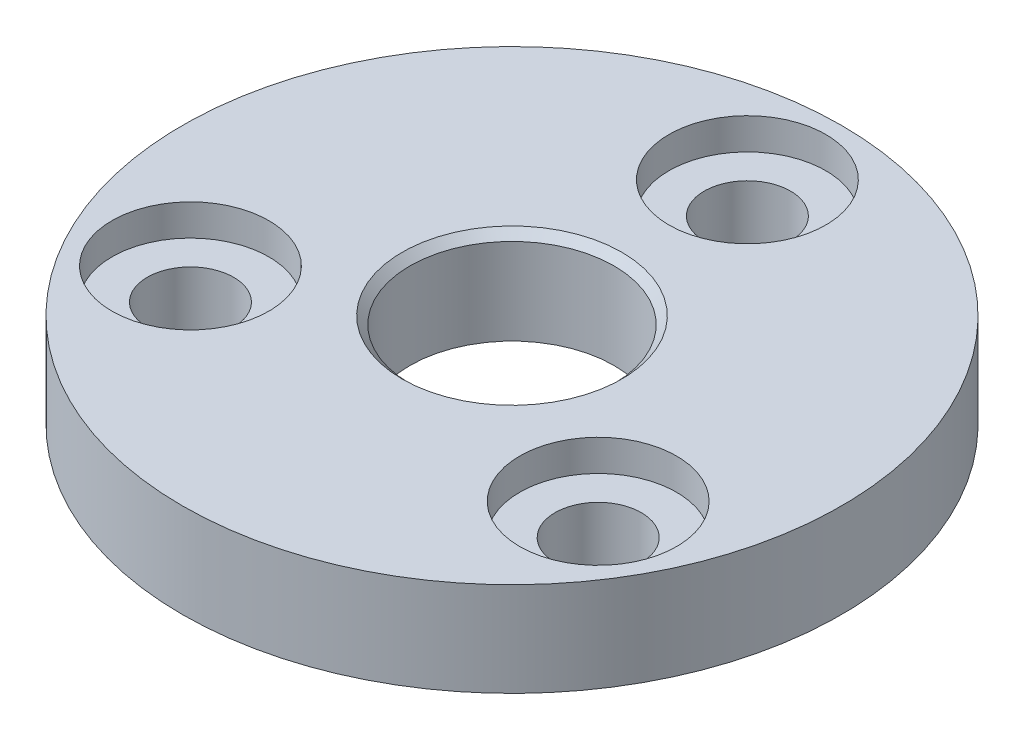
ISO-10303-21;
HEADER;
FILE_DESCRIPTION(('STEP AP214'),'2;1');
FILE_NAME('part.step','',(''),(''),'','','');
FILE_SCHEMA(('AUTOMOTIVE_DESIGN { 1 0 10303 214 1 1 1 1 }'));
ENDSEC;
DATA;
#1=APPLICATION_CONTEXT('core data for automotive mechanical design processes');
#2=APPLICATION_PROTOCOL_DEFINITION('international standard','automotive_design',2000,#1);
#3=PRODUCT_CONTEXT('',#1,'mechanical');
#4=PRODUCT('Part','Part','',(#3));
#5=PRODUCT_RELATED_PRODUCT_CATEGORY('part','',(#4));
#6=PRODUCT_DEFINITION_FORMATION('','',#4);
#7=PRODUCT_DEFINITION_CONTEXT('part definition',#1,'design');
#8=PRODUCT_DEFINITION('design','',#6,#7);
#9=PRODUCT_DEFINITION_SHAPE('','',#8);
#10=(LENGTH_UNIT() NAMED_UNIT(*) SI_UNIT(.MILLI.,.METRE.));
#11=(NAMED_UNIT(*) PLANE_ANGLE_UNIT() SI_UNIT($,.RADIAN.));
#12=(NAMED_UNIT(*) SI_UNIT($,.STERADIAN.) SOLID_ANGLE_UNIT());
#13=UNCERTAINTY_MEASURE_WITH_UNIT(LENGTH_MEASURE(1.E-05),#10,'distance_accuracy_value','');
#14=(GEOMETRIC_REPRESENTATION_CONTEXT(3) GLOBAL_UNCERTAINTY_ASSIGNED_CONTEXT((#13)) GLOBAL_UNIT_ASSIGNED_CONTEXT((#10,
#11,#12)) REPRESENTATION_CONTEXT('',''));
#15=CARTESIAN_POINT('',(0.,0.,0.));
#16=DIRECTION('',(0.,0.,1.));
#17=DIRECTION('',(1.,0.,0.));
#18=AXIS2_PLACEMENT_3D('',#15,#16,#17);
#19=CARTESIAN_POINT('',(0.,3.,0.));
#20=DIRECTION('',(0.,-1.,0.));
#21=DIRECTION('',(0.,0.,-1.));
#22=AXIS2_PLACEMENT_3D('',#19,#20,#21);
#23=CYLINDRICAL_SURFACE('',#22,21.);
#24=CARTESIAN_POINT('',(0.,3.,0.));
#25=DIRECTION('',(0.,1.,0.));
#26=DIRECTION('',(0.,0.,1.));
#27=AXIS2_PLACEMENT_3D('',#24,#25,#26);
#28=CIRCLE('',#27,21.);
#29=CARTESIAN_POINT('',(0.,3.,21.));
#30=VERTEX_POINT('',#29);
#31=EDGE_CURVE('E48',#30,#30,#28,.T.);
#32=ORIENTED_EDGE('',*,*,#31,.F.);
#33=EDGE_LOOP('',(#32));
#34=FACE_BOUND('',#33,.T.);
#35=CARTESIAN_POINT('',(0.,-3.,0.));
#36=DIRECTION('',(0.,1.,0.));
#37=DIRECTION('',(0.,0.,1.));
#38=AXIS2_PLACEMENT_3D('',#35,#36,#37);
#39=CIRCLE('',#38,21.);
#40=CARTESIAN_POINT('',(0.,-3.,21.));
#41=VERTEX_POINT('',#40);
#42=EDGE_CURVE('E54',#41,#41,#39,.T.);
#43=ORIENTED_EDGE('',*,*,#42,.T.);
#44=EDGE_LOOP('',(#43));
#45=FACE_BOUND('',#44,.T.);
#46=ADVANCED_FACE('F34',(#34,#45),#23,.T.);
#47=CARTESIAN_POINT('',(0.,3.,0.));
#48=DIRECTION('',(0.,1.,0.));
#49=DIRECTION('',(0.,0.,1.));
#50=AXIS2_PLACEMENT_3D('',#47,#48,#49);
#51=PLANE('',#50);
#52=CARTESIAN_POINT('',(0.,3.,0.));
#53=DIRECTION('',(0.,1.,0.));
#54=DIRECTION('',(0.,0.,1.));
#55=AXIS2_PLACEMENT_3D('',#52,#53,#54);
#56=CIRCLE('',#55,7.00000000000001);
#57=CARTESIAN_POINT('',(0.,3.,7.00000000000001));
#58=VERTEX_POINT('',#57);
#59=EDGE_CURVE('E10',#58,#58,#56,.F.);
#60=ORIENTED_EDGE('',*,*,#59,.T.);
#61=EDGE_LOOP('',(#60));
#62=FACE_BOUND('',#61,.T.);
#63=CARTESIAN_POINT('',(-12.9903810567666,3.,7.49999999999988));
#64=DIRECTION('',(0.,1.,0.));
#65=DIRECTION('',(0.,0.,1.));
#66=AXIS2_PLACEMENT_3D('',#63,#64,#65);
#67=CIRCLE('',#66,4.99999999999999);
#68=CARTESIAN_POINT('',(-12.9903810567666,3.,12.4999999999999));
#69=VERTEX_POINT('',#68);
#70=EDGE_CURVE('E102',#69,#69,#67,.T.);
#71=ORIENTED_EDGE('',*,*,#70,.F.);
#72=EDGE_LOOP('',(#71));
#73=FACE_BOUND('',#72,.T.);
#74=CARTESIAN_POINT('',(12.9903810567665,3.,7.50000000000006));
#75=DIRECTION('',(0.,1.,0.));
#76=DIRECTION('',(0.,0.,1.));
#77=AXIS2_PLACEMENT_3D('',#74,#75,#76);
#78=CIRCLE('',#77,5.);
#79=CARTESIAN_POINT('',(12.9903810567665,3.,12.5000000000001));
#80=VERTEX_POINT('',#79);
#81=EDGE_CURVE('E88',#80,#80,#78,.T.);
#82=ORIENTED_EDGE('',*,*,#81,.F.);
#83=EDGE_LOOP('',(#82));
#84=FACE_BOUND('',#83,.T.);
#85=CARTESIAN_POINT('',(0.,3.,-15.));
#86=DIRECTION('',(0.,1.,0.));
#87=DIRECTION('',(0.,0.,1.));
#88=AXIS2_PLACEMENT_3D('',#85,#86,#87);
#89=CIRCLE('',#88,4.99999999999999);
#90=CARTESIAN_POINT('',(0.,3.,-10.));
#91=VERTEX_POINT('',#90);
#92=EDGE_CURVE('E72',#91,#91,#89,.T.);
#93=ORIENTED_EDGE('',*,*,#92,.F.);
#94=EDGE_LOOP('',(#93));
#95=FACE_BOUND('',#94,.T.);
#96=ORIENTED_EDGE('',*,*,#31,.T.);
#97=EDGE_LOOP('',(#96));
#98=FACE_BOUND('',#97,.T.);
#99=ADVANCED_FACE('F127',(#62,#73,#84,#95,#98),#51,.T.);
#100=CARTESIAN_POINT('',(0.,-3.,0.));
#101=DIRECTION('',(0.,1.,0.));
#102=DIRECTION('',(0.,0.,1.));
#103=AXIS2_PLACEMENT_3D('',#100,#101,#102);
#104=PLANE('',#103);
#105=CARTESIAN_POINT('',(0.,-3.,0.));
#106=DIRECTION('',(0.,1.,0.));
#107=DIRECTION('',(0.,0.,1.));
#108=AXIS2_PLACEMENT_3D('',#105,#106,#107);
#109=CIRCLE('',#108,6.5);
#110=CARTESIAN_POINT('',(0.,-3.,6.5));
#111=VERTEX_POINT('',#110);
#112=EDGE_CURVE('E106',#111,#111,#109,.T.);
#113=ORIENTED_EDGE('',*,*,#112,.T.);
#114=EDGE_LOOP('',(#113));
#115=FACE_BOUND('',#114,.T.);
#116=CARTESIAN_POINT('',(-12.9903810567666,-3.,7.49999999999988));
#117=DIRECTION('',(0.,1.,0.));
#118=DIRECTION('',(0.,0.,1.));
#119=AXIS2_PLACEMENT_3D('',#116,#117,#118);
#120=CIRCLE('',#119,2.75);
#121=CARTESIAN_POINT('',(-12.9903810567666,-3.,10.2499999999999));
#122=VERTEX_POINT('',#121);
#123=EDGE_CURVE('E92',#122,#122,#120,.T.);
#124=ORIENTED_EDGE('',*,*,#123,.T.);
#125=EDGE_LOOP('',(#124));
#126=FACE_BOUND('',#125,.T.);
#127=CARTESIAN_POINT('',(12.9903810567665,-3.,7.50000000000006));
#128=DIRECTION('',(0.,1.,0.));
#129=DIRECTION('',(0.,0.,1.));
#130=AXIS2_PLACEMENT_3D('',#127,#128,#129);
#131=CIRCLE('',#130,2.75);
#132=CARTESIAN_POINT('',(12.9903810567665,-3.,10.2500000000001));
#133=VERTEX_POINT('',#132);
#134=EDGE_CURVE('E76',#133,#133,#131,.T.);
#135=ORIENTED_EDGE('',*,*,#134,.T.);
#136=EDGE_LOOP('',(#135));
#137=FACE_BOUND('',#136,.T.);
#138=CARTESIAN_POINT('',(0.,-3.,-15.));
#139=DIRECTION('',(0.,1.,0.));
#140=DIRECTION('',(0.,0.,1.));
#141=AXIS2_PLACEMENT_3D('',#138,#139,#140);
#142=CIRCLE('',#141,2.75);
#143=CARTESIAN_POINT('',(0.,-3.,-12.25));
#144=VERTEX_POINT('',#143);
#145=EDGE_CURVE('E59',#144,#144,#142,.T.);
#146=ORIENTED_EDGE('',*,*,#145,.T.);
#147=EDGE_LOOP('',(#146));
#148=FACE_BOUND('',#147,.T.);
#149=ORIENTED_EDGE('',*,*,#42,.F.);
#150=EDGE_LOOP('',(#149));
#151=FACE_BOUND('',#150,.T.);
#152=ADVANCED_FACE('F111',(#115,#126,#137,#148,#151),#104,.F.);
#153=CARTESIAN_POINT('',(0.,3.,-15.));
#154=DIRECTION('',(0.,1.,0.));
#155=DIRECTION('',(0.,0.,1.));
#156=AXIS2_PLACEMENT_3D('',#153,#154,#155);
#157=CYLINDRICAL_SURFACE('',#156,2.75);
#158=ORIENTED_EDGE('',*,*,#145,.F.);
#159=EDGE_LOOP('',(#158));
#160=FACE_BOUND('',#159,.T.);
#161=CARTESIAN_POINT('',(0.,1.,-15.));
#162=DIRECTION('',(0.,1.,0.));
#163=DIRECTION('',(0.,0.,1.));
#164=AXIS2_PLACEMENT_3D('',#161,#162,#163);
#165=CIRCLE('',#164,2.75);
#166=CARTESIAN_POINT('',(0.,1.,-12.25));
#167=VERTEX_POINT('',#166);
#168=EDGE_CURVE('E64',#167,#167,#165,.T.);
#169=ORIENTED_EDGE('',*,*,#168,.T.);
#170=EDGE_LOOP('',(#169));
#171=FACE_BOUND('',#170,.T.);
#172=ADVANCED_FACE('F137',(#160,#171),#157,.F.);
#173=CARTESIAN_POINT('',(2.75,1.,-15.));
#174=DIRECTION('',(0.,-1.,0.));
#175=DIRECTION('',(0.,0.,-1.));
#176=AXIS2_PLACEMENT_3D('',#173,#174,#175);
#177=PLANE('',#176);
#178=ORIENTED_EDGE('',*,*,#168,.F.);
#179=EDGE_LOOP('',(#178));
#180=FACE_BOUND('',#179,.T.);
#181=CARTESIAN_POINT('',(0.,1.,-15.));
#182=DIRECTION('',(0.,1.,0.));
#183=DIRECTION('',(0.,0.,1.));
#184=AXIS2_PLACEMENT_3D('',#181,#182,#183);
#185=CIRCLE('',#184,5.);
#186=CARTESIAN_POINT('',(0.,1.,-10.));
#187=VERTEX_POINT('',#186);
#188=EDGE_CURVE('E68',#187,#187,#185,.T.);
#189=ORIENTED_EDGE('',*,*,#188,.T.);
#190=EDGE_LOOP('',(#189));
#191=FACE_BOUND('',#190,.T.);
#192=ADVANCED_FACE('F141',(#180,#191),#177,.F.);
#193=CARTESIAN_POINT('',(0.,3.,-15.));
#194=DIRECTION('',(0.,1.,0.));
#195=DIRECTION('',(0.,0.,1.));
#196=AXIS2_PLACEMENT_3D('',#193,#194,#195);
#197=CYLINDRICAL_SURFACE('',#196,5.);
#198=ORIENTED_EDGE('',*,*,#188,.F.);
#199=EDGE_LOOP('',(#198));
#200=FACE_BOUND('',#199,.T.);
#201=ORIENTED_EDGE('',*,*,#92,.T.);
#202=EDGE_LOOP('',(#201));
#203=FACE_BOUND('',#202,.T.);
#204=ADVANCED_FACE('F145',(#200,#203),#197,.F.);
#205=CARTESIAN_POINT('',(12.9903810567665,3.,7.50000000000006));
#206=DIRECTION('',(0.,1.,0.));
#207=DIRECTION('',(0.,0.,1.));
#208=AXIS2_PLACEMENT_3D('',#205,#206,#207);
#209=CYLINDRICAL_SURFACE('',#208,2.75);
#210=ORIENTED_EDGE('',*,*,#134,.F.);
#211=EDGE_LOOP('',(#210));
#212=FACE_BOUND('',#211,.T.);
#213=CARTESIAN_POINT('',(12.9903810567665,1.,7.50000000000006));
#214=DIRECTION('',(0.,1.,0.));
#215=DIRECTION('',(0.,0.,1.));
#216=AXIS2_PLACEMENT_3D('',#213,#214,#215);
#217=CIRCLE('',#216,2.75);
#218=CARTESIAN_POINT('',(12.9903810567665,1.,10.2500000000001));
#219=VERTEX_POINT('',#218);
#220=EDGE_CURVE('E80',#219,#219,#217,.T.);
#221=ORIENTED_EDGE('',*,*,#220,.T.);
#222=EDGE_LOOP('',(#221));
#223=FACE_BOUND('',#222,.T.);
#224=ADVANCED_FACE('F149',(#212,#223),#209,.F.);
#225=CARTESIAN_POINT('',(15.7403810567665,1.,7.50000000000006));
#226=DIRECTION('',(0.,-1.,0.));
#227=DIRECTION('',(0.,0.,-1.));
#228=AXIS2_PLACEMENT_3D('',#225,#226,#227);
#229=PLANE('',#228);
#230=ORIENTED_EDGE('',*,*,#220,.F.);
#231=EDGE_LOOP('',(#230));
#232=FACE_BOUND('',#231,.T.);
#233=CARTESIAN_POINT('',(12.9903810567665,1.,7.50000000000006));
#234=DIRECTION('',(0.,1.,0.));
#235=DIRECTION('',(0.,0.,1.));
#236=AXIS2_PLACEMENT_3D('',#233,#234,#235);
#237=CIRCLE('',#236,5.);
#238=CARTESIAN_POINT('',(12.9903810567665,1.,12.5000000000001));
#239=VERTEX_POINT('',#238);
#240=EDGE_CURVE('E84',#239,#239,#237,.T.);
#241=ORIENTED_EDGE('',*,*,#240,.T.);
#242=EDGE_LOOP('',(#241));
#243=FACE_BOUND('',#242,.T.);
#244=ADVANCED_FACE('F153',(#232,#243),#229,.F.);
#245=CARTESIAN_POINT('',(12.9903810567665,3.,7.50000000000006));
#246=DIRECTION('',(0.,1.,0.));
#247=DIRECTION('',(0.,0.,1.));
#248=AXIS2_PLACEMENT_3D('',#245,#246,#247);
#249=CYLINDRICAL_SURFACE('',#248,5.);
#250=ORIENTED_EDGE('',*,*,#240,.F.);
#251=EDGE_LOOP('',(#250));
#252=FACE_BOUND('',#251,.T.);
#253=ORIENTED_EDGE('',*,*,#81,.T.);
#254=EDGE_LOOP('',(#253));
#255=FACE_BOUND('',#254,.T.);
#256=ADVANCED_FACE('F157',(#252,#255),#249,.F.);
#257=CARTESIAN_POINT('',(-12.9903810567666,3.,7.49999999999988));
#258=DIRECTION('',(0.,1.,0.));
#259=DIRECTION('',(0.,0.,1.));
#260=AXIS2_PLACEMENT_3D('',#257,#258,#259);
#261=CYLINDRICAL_SURFACE('',#260,2.75);
#262=ORIENTED_EDGE('',*,*,#123,.F.);
#263=EDGE_LOOP('',(#262));
#264=FACE_BOUND('',#263,.T.);
#265=CARTESIAN_POINT('',(-12.9903810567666,1.,7.49999999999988));
#266=DIRECTION('',(0.,1.,0.));
#267=DIRECTION('',(0.,0.,1.));
#268=AXIS2_PLACEMENT_3D('',#265,#266,#267);
#269=CIRCLE('',#268,2.75);
#270=CARTESIAN_POINT('',(-12.9903810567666,1.,10.2499999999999));
#271=VERTEX_POINT('',#270);
#272=EDGE_CURVE('E95',#271,#271,#269,.T.);
#273=ORIENTED_EDGE('',*,*,#272,.T.);
#274=EDGE_LOOP('',(#273));
#275=FACE_BOUND('',#274,.T.);
#276=ADVANCED_FACE('F161',(#264,#275),#261,.F.);
#277=CARTESIAN_POINT('',(-10.2403810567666,1.,7.49999999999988));
#278=DIRECTION('',(0.,-1.,0.));
#279=DIRECTION('',(0.,0.,-1.));
#280=AXIS2_PLACEMENT_3D('',#277,#278,#279);
#281=PLANE('',#280);
#282=ORIENTED_EDGE('',*,*,#272,.F.);
#283=EDGE_LOOP('',(#282));
#284=FACE_BOUND('',#283,.T.);
#285=CARTESIAN_POINT('',(-12.9903810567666,1.,7.49999999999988));
#286=DIRECTION('',(0.,1.,0.));
#287=DIRECTION('',(0.,0.,1.));
#288=AXIS2_PLACEMENT_3D('',#285,#286,#287);
#289=CIRCLE('',#288,5.);
#290=CARTESIAN_POINT('',(-12.9903810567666,1.,12.4999999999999));
#291=VERTEX_POINT('',#290);
#292=EDGE_CURVE('E99',#291,#291,#289,.T.);
#293=ORIENTED_EDGE('',*,*,#292,.T.);
#294=EDGE_LOOP('',(#293));
#295=FACE_BOUND('',#294,.T.);
#296=ADVANCED_FACE('F123',(#284,#295),#281,.F.);
#297=CARTESIAN_POINT('',(-12.9903810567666,3.,7.49999999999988));
#298=DIRECTION('',(0.,1.,0.));
#299=DIRECTION('',(0.,0.,1.));
#300=AXIS2_PLACEMENT_3D('',#297,#298,#299);
#301=CYLINDRICAL_SURFACE('',#300,5.);
#302=ORIENTED_EDGE('',*,*,#292,.F.);
#303=EDGE_LOOP('',(#302));
#304=FACE_BOUND('',#303,.T.);
#305=ORIENTED_EDGE('',*,*,#70,.T.);
#306=EDGE_LOOP('',(#305));
#307=FACE_BOUND('',#306,.T.);
#308=ADVANCED_FACE('F116',(#304,#307),#301,.F.);
#309=CARTESIAN_POINT('',(0.,3.,0.));
#310=DIRECTION('',(0.,1.,0.));
#311=DIRECTION('',(0.,0.,1.));
#312=AXIS2_PLACEMENT_3D('',#309,#310,#311);
#313=CYLINDRICAL_SURFACE('',#312,6.5);
#314=CARTESIAN_POINT('',(0.,2.49999999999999,0.));
#315=DIRECTION('',(0.,1.,0.));
#316=DIRECTION('',(0.,0.,1.));
#317=AXIS2_PLACEMENT_3D('',#314,#315,#316);
#318=CIRCLE('',#317,6.5);
#319=CARTESIAN_POINT('',(0.,2.49999999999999,6.5));
#320=VERTEX_POINT('',#319);
#321=EDGE_CURVE('E42',#320,#320,#318,.T.);
#322=ORIENTED_EDGE('',*,*,#321,.T.);
#323=EDGE_LOOP('',(#322));
#324=FACE_BOUND('',#323,.T.);
#325=ORIENTED_EDGE('',*,*,#112,.F.);
#326=EDGE_LOOP('',(#325));
#327=FACE_BOUND('',#326,.T.);
#328=ADVANCED_FACE('F114',(#324,#327),#313,.F.);
#329=CARTESIAN_POINT('',(0.,2.49999999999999,0.));
#330=DIRECTION('',(0.,1.,0.));
#331=DIRECTION('',(0.,0.,1.));
#332=AXIS2_PLACEMENT_3D('',#329,#330,#331);
#333=CONICAL_SURFACE('',#332,6.5,0.785398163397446);
#334=ORIENTED_EDGE('',*,*,#59,.F.);
#335=EDGE_LOOP('',(#334));
#336=FACE_BOUND('',#335,.T.);
#337=ORIENTED_EDGE('',*,*,#321,.F.);
#338=EDGE_LOOP('',(#337));
#339=FACE_BOUND('',#338,.T.);
#340=ADVANCED_FACE('F36',(#336,#339),#333,.F.);
#341=CLOSED_SHELL('',(#46,#99,#152,#172,#192,#204,#224,#244,#256,#276,#296,#308,#328,#340));
#342=MANIFOLD_SOLID_BREP('B2',#341);
#343=ADVANCED_BREP_SHAPE_REPRESENTATION('',(#18,#342),#14);
#344=SHAPE_DEFINITION_REPRESENTATION(#9,#343);
ENDSEC;
END-ISO-10303-21;
